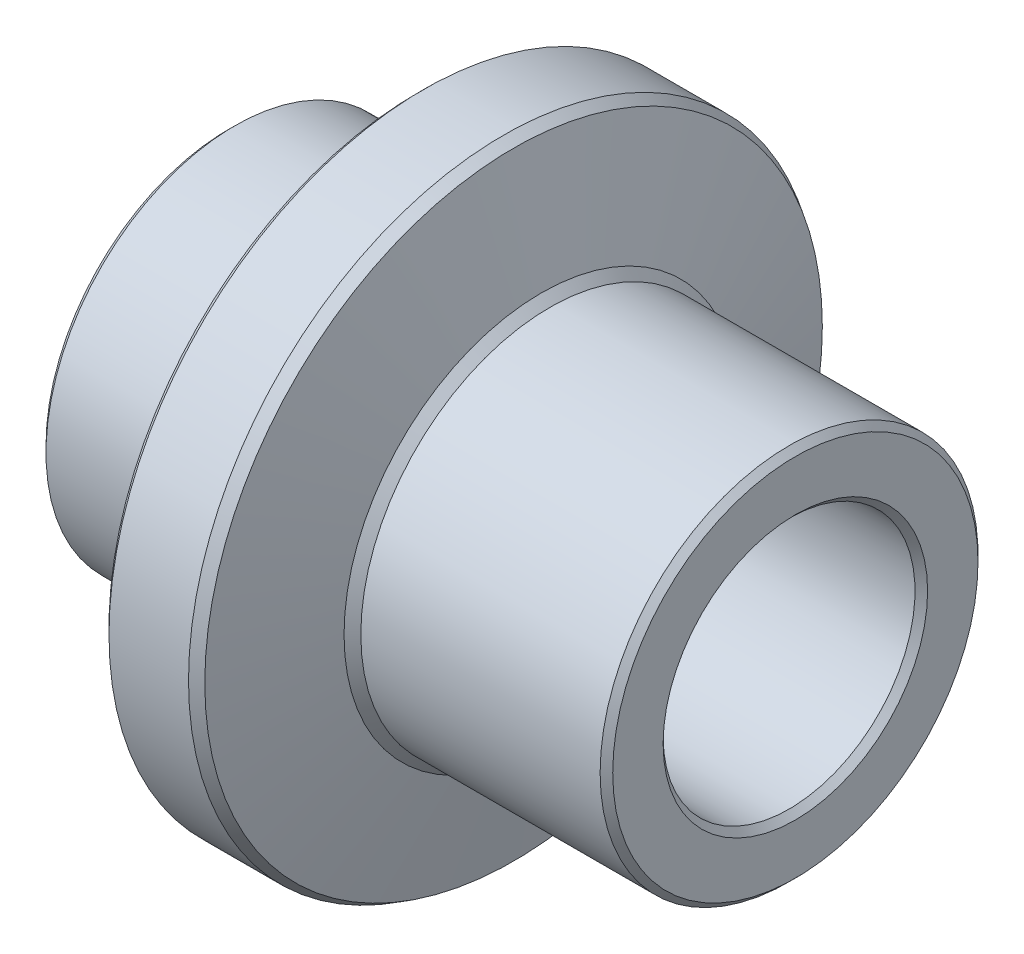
from build123d import *
from OCP.BRepFilletAPI import BRepFilletAPI_MakeChamfer

# Parameters (mm, degrees)
CHAMFER_1_SIZE  = 0.2
CHAMFER_1_SIZE2 = 0.274584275


with BuildPart() as part:
    # Sketch 1 → Revolve 1 (revolve)
    with BuildSketch(Plane.XY, mode=Mode.PRIVATE) as revolve_1_sk:
        Polygon((17.997312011, 4), (0, 4), (0, 6), (6, 6), (6, 10), (9, 10), (9.997312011, 6), (17.997312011, 6), align=None)
    revolve(revolve_1_sk.sketch.rotate(Axis((0, 0, 0), (1, 0, 0)), 90), axis=Axis((0, 0, 0), (1, 0, 0)))

    # Chamfer 1: one chamfer whose edges measure the first distance from different faces: ONE call of the kernel's chamfer builder (chamfer() names one face for all edges)
    chamfer_1_edges_1 = [part.edges().sort_by_distance(p)[0] for p in [
        (17.997312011, 0, -6),
        (6, 0, -10),
        (6, 0, -6),
        (0, 0, -6),
        (0, 0, -4),
        (17.997312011, 0, -4),
    ]]
    chamfer_1_edges_2 = [part.edges().sort_by_distance(p)[0] for p in [
        (9.997312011, 0, -6),
    ]]
    chamfer_1_side_2 = [part.faces().sort_by_distance(p)[0] for p in [
        (13.997312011, 0, -6),
    ]]
    chamfer_1_edges_3 = [part.edges().sort_by_distance(p)[0] for p in [
        (9, 0, -10),
    ]]
    chamfer_1_side_3 = [part.faces().sort_by_distance(p)[0] for p in [
        (9.498656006, 0, -8),
    ]]
    chamfer_1 = BRepFilletAPI_MakeChamfer(part.part.solid().wrapped)
    for e in chamfer_1_edges_1:
        chamfer_1.Add(CHAMFER_1_SIZE, e.wrapped)
    for e in chamfer_1_edges_2:
        chamfer_1.Add(CHAMFER_1_SIZE, CHAMFER_1_SIZE2, e.wrapped, chamfer_1_side_2[0].wrapped)  # the first distance lies on this face
    for e in chamfer_1_edges_3:
        chamfer_1.Add(CHAMFER_1_SIZE, CHAMFER_1_SIZE2, e.wrapped, chamfer_1_side_3[0].wrapped)  # the first distance lies on this face
    add(Compound.cast(chamfer_1.Shape()), mode=Mode.REPLACE)


solid = part.part
